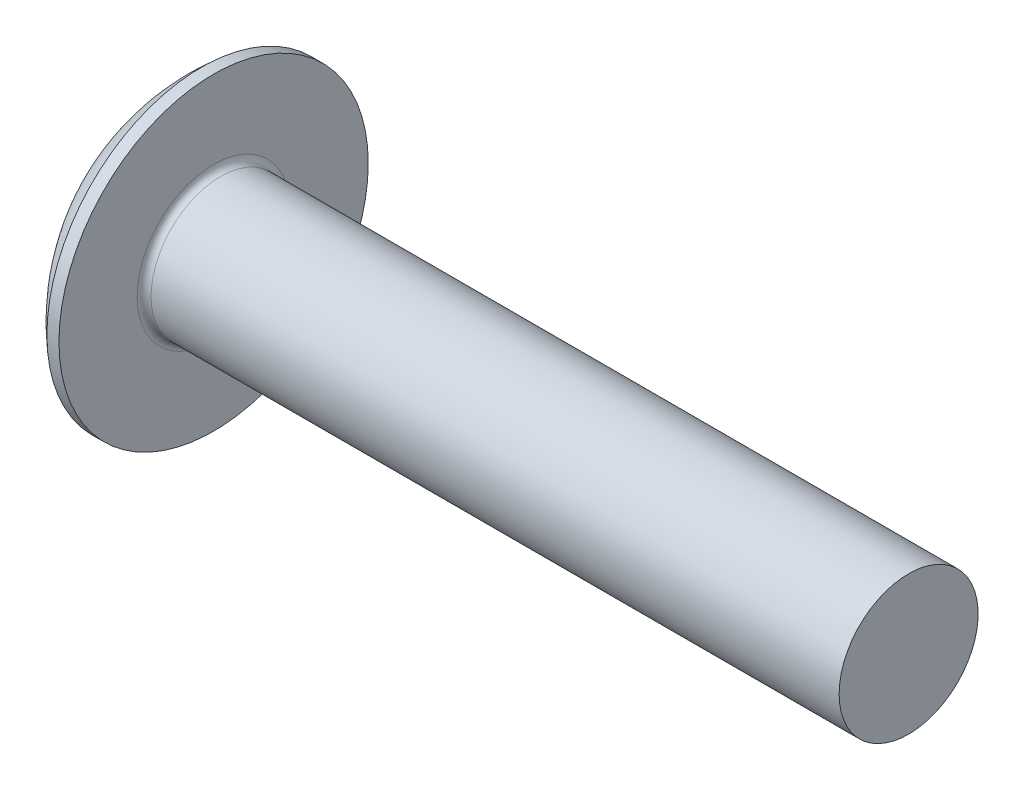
from build123d import *

# Parameters (mm, degrees)
FILLET1_R  = 0.4
SLOTSKE_W  = 17.8
SLOTSKE_H  = 1.6
SLOT_DEPTH = 2.4


with BuildPart() as part:
    # BodySke → BaseBody (revolve)
    with BuildSketch(Plane.XY, mode=Mode.PRIVATE) as basebody_sk:
        with BuildLine():
            Line((4.8, 8.9), (4.8, 4))
            Line((4.8, 4), (44.8, 4))
            Line((44.8, 4), (44.8, 0))
            Line((44.8, 0), (0, 0))
            ThreePointArc((0, 0), (1.075772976, 4.900591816), (4.105264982, 8.9))
            Line((4.105264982, 8.9), (4.8, 8.9))
        make_face()
    revolve(basebody_sk.sketch.rotate(Axis((0, 0, 0), (1, 0, 0)), 90), axis=Axis((0, 0, 0), (1, 0, 0)))

    # Fillet1
    fillet1_edges = [part.edges().sort_by_distance(p)[0] for p in [
        (4.8, 0, -4),
    ]]
    fillet(fillet1_edges, radius=FILLET1_R)

    # SlotSke → Slot (cut)
    with BuildSketch(Plane(origin=(0, 0, 0), x_dir=(0, 0, -1), z_dir=(1, 0, 0))):
        Rectangle(SLOTSKE_W, SLOTSKE_H)
    extrude(amount=SLOT_DEPTH, mode=Mode.SUBTRACT)


solid = part.part
